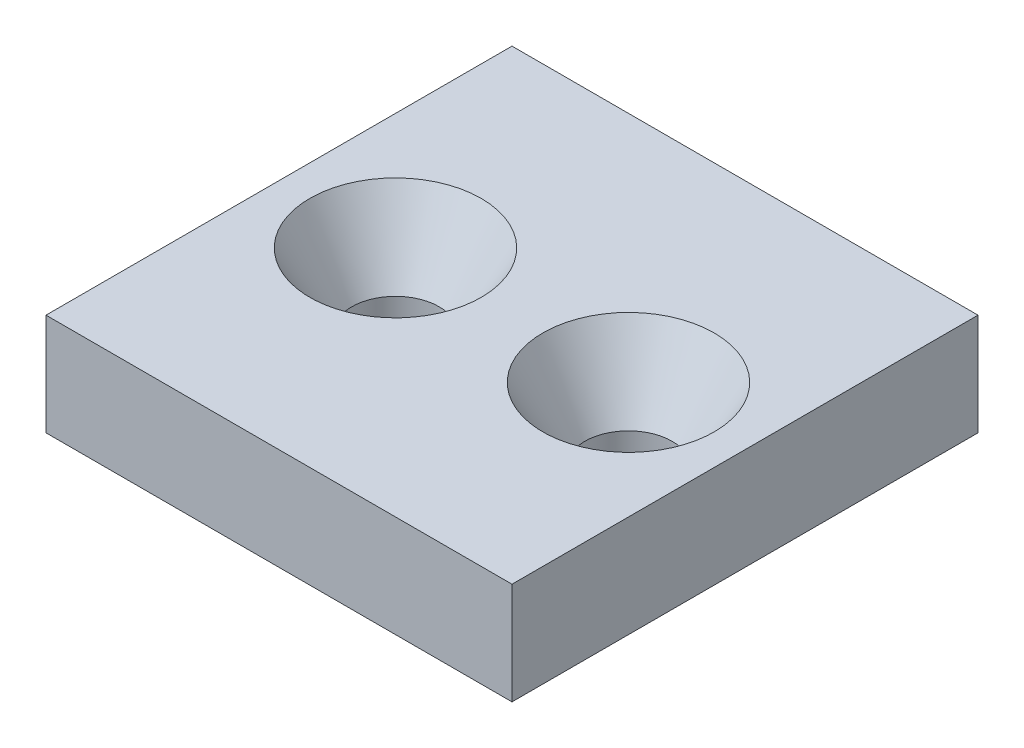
ISO-10303-21;
HEADER;
FILE_DESCRIPTION(('STEP AP214'),'2;1');
FILE_NAME('part.step','',(''),(''),'','','');
FILE_SCHEMA(('AUTOMOTIVE_DESIGN { 1 0 10303 214 1 1 1 1 }'));
ENDSEC;
DATA;
#1=APPLICATION_CONTEXT('core data for automotive mechanical design processes');
#2=APPLICATION_PROTOCOL_DEFINITION('international standard','automotive_design',2000,#1);
#3=PRODUCT_CONTEXT('',#1,'mechanical');
#4=PRODUCT('Part','Part','',(#3));
#5=PRODUCT_RELATED_PRODUCT_CATEGORY('part','',(#4));
#6=PRODUCT_DEFINITION_FORMATION('','',#4);
#7=PRODUCT_DEFINITION_CONTEXT('part definition',#1,'design');
#8=PRODUCT_DEFINITION('design','',#6,#7);
#9=PRODUCT_DEFINITION_SHAPE('','',#8);
#10=(LENGTH_UNIT() NAMED_UNIT(*) SI_UNIT(.MILLI.,.METRE.));
#11=(NAMED_UNIT(*) PLANE_ANGLE_UNIT() SI_UNIT($,.RADIAN.));
#12=(NAMED_UNIT(*) SI_UNIT($,.STERADIAN.) SOLID_ANGLE_UNIT());
#13=UNCERTAINTY_MEASURE_WITH_UNIT(LENGTH_MEASURE(1.E-05),#10,'distance_accuracy_value','');
#14=(GEOMETRIC_REPRESENTATION_CONTEXT(3) GLOBAL_UNCERTAINTY_ASSIGNED_CONTEXT((#13)) GLOBAL_UNIT_ASSIGNED_CONTEXT((#10,
#11,#12)) REPRESENTATION_CONTEXT('',''));
#15=CARTESIAN_POINT('',(0.,0.,0.));
#16=DIRECTION('',(0.,0.,1.));
#17=DIRECTION('',(1.,0.,0.));
#18=AXIS2_PLACEMENT_3D('',#15,#16,#17);
#19=CARTESIAN_POINT('',(16.,7.,-16.));
#20=DIRECTION('',(0.,-1.,0.));
#21=DIRECTION('',(0.,0.,-1.));
#22=AXIS2_PLACEMENT_3D('',#19,#20,#21);
#23=PLANE('',#22);
#24=CARTESIAN_POINT('',(-8.,7.,0.));
#25=DIRECTION('',(0.,-1.,0.));
#26=DIRECTION('',(0.,0.,-1.));
#27=AXIS2_PLACEMENT_3D('',#24,#25,#26);
#28=CIRCLE('',#27,5.88675134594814);
#29=CARTESIAN_POINT('',(-8.,7.,-5.88675134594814));
#30=VERTEX_POINT('',#29);
#31=EDGE_CURVE('E98',#30,#30,#28,.T.);
#32=ORIENTED_EDGE('',*,*,#31,.T.);
#33=EDGE_LOOP('',(#32));
#34=FACE_BOUND('',#33,.T.);
#35=DIRECTION('',(0.,0.,-1.));
#36=VECTOR('',#35,1.);
#37=CARTESIAN_POINT('',(16.,7.,16.));
#38=LINE('',#37,#36);
#39=CARTESIAN_POINT('',(16.,7.,16.));
#40=VERTEX_POINT('',#39);
#41=CARTESIAN_POINT('',(16.,7.,-16.));
#42=VERTEX_POINT('',#41);
#43=EDGE_CURVE('E83',#40,#42,#38,.T.);
#44=ORIENTED_EDGE('',*,*,#43,.T.);
#45=DIRECTION('',(-1.,0.,0.));
#46=VECTOR('',#45,1.);
#47=CARTESIAN_POINT('',(-16.,7.,-16.));
#48=LINE('',#47,#46);
#49=CARTESIAN_POINT('',(-16.,7.,-16.));
#50=VERTEX_POINT('',#49);
#51=EDGE_CURVE('E78',#42,#50,#48,.T.);
#52=ORIENTED_EDGE('',*,*,#51,.T.);
#53=DIRECTION('',(0.,0.,1.));
#54=VECTOR('',#53,1.);
#55=CARTESIAN_POINT('',(-16.,7.,16.));
#56=LINE('',#55,#54);
#57=CARTESIAN_POINT('',(-16.,7.,16.));
#58=VERTEX_POINT('',#57);
#59=EDGE_CURVE('E81',#50,#58,#56,.T.);
#60=ORIENTED_EDGE('',*,*,#59,.T.);
#61=DIRECTION('',(1.,0.,0.));
#62=VECTOR('',#61,1.);
#63=CARTESIAN_POINT('',(-16.,7.,16.));
#64=LINE('',#63,#62);
#65=EDGE_CURVE('E48',#58,#40,#64,.T.);
#66=ORIENTED_EDGE('',*,*,#65,.T.);
#67=EDGE_LOOP('',(#44,#52,#60,#66));
#68=FACE_BOUND('',#67,.T.);
#69=CARTESIAN_POINT('',(8.,7.,0.));
#70=DIRECTION('',(0.,1.,0.));
#71=DIRECTION('',(0.,0.,-1.));
#72=AXIS2_PLACEMENT_3D('',#69,#70,#71);
#73=CIRCLE('',#72,5.88675134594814);
#74=CARTESIAN_POINT('',(8.,7.,-5.88675134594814));
#75=VERTEX_POINT('',#74);
#76=EDGE_CURVE('E118',#75,#75,#73,.T.);
#77=ORIENTED_EDGE('',*,*,#76,.F.);
#78=EDGE_LOOP('',(#77));
#79=FACE_BOUND('',#78,.T.);
#80=ADVANCED_FACE('F31',(#34,#68,#79),#23,.F.);
#81=CARTESIAN_POINT('',(16.,0.,-16.));
#82=DIRECTION('',(0.,-1.,0.));
#83=DIRECTION('',(0.,0.,-1.));
#84=AXIS2_PLACEMENT_3D('',#81,#82,#83);
#85=PLANE('',#84);
#86=CARTESIAN_POINT('',(-8.,0.,0.));
#87=DIRECTION('',(0.,-1.,0.));
#88=DIRECTION('',(0.,0.,-1.));
#89=AXIS2_PLACEMENT_3D('',#86,#87,#88);
#90=CIRCLE('',#89,3.);
#91=CARTESIAN_POINT('',(-8.,0.,-3.));
#92=VERTEX_POINT('',#91);
#93=EDGE_CURVE('E115',#92,#92,#90,.T.);
#94=ORIENTED_EDGE('',*,*,#93,.F.);
#95=EDGE_LOOP('',(#94));
#96=FACE_BOUND('',#95,.T.);
#97=DIRECTION('',(0.,0.,-1.));
#98=VECTOR('',#97,1.);
#99=CARTESIAN_POINT('',(16.,0.,16.));
#100=LINE('',#99,#98);
#101=CARTESIAN_POINT('',(16.,0.,16.));
#102=VERTEX_POINT('',#101);
#103=CARTESIAN_POINT('',(16.,0.,-16.));
#104=VERTEX_POINT('',#103);
#105=EDGE_CURVE('E95',#102,#104,#100,.T.);
#106=ORIENTED_EDGE('',*,*,#105,.F.);
#107=DIRECTION('',(1.,0.,0.));
#108=VECTOR('',#107,1.);
#109=CARTESIAN_POINT('',(-16.,0.,16.));
#110=LINE('',#109,#108);
#111=CARTESIAN_POINT('',(-16.,0.,16.));
#112=VERTEX_POINT('',#111);
#113=EDGE_CURVE('E71',#112,#102,#110,.T.);
#114=ORIENTED_EDGE('',*,*,#113,.F.);
#115=DIRECTION('',(0.,0.,1.));
#116=VECTOR('',#115,1.);
#117=CARTESIAN_POINT('',(-16.,0.,16.));
#118=LINE('',#117,#116);
#119=CARTESIAN_POINT('',(-16.,0.,-16.));
#120=VERTEX_POINT('',#119);
#121=EDGE_CURVE('E65',#120,#112,#118,.T.);
#122=ORIENTED_EDGE('',*,*,#121,.F.);
#123=DIRECTION('',(-1.,0.,0.));
#124=VECTOR('',#123,1.);
#125=CARTESIAN_POINT('',(-16.,0.,-16.));
#126=LINE('',#125,#124);
#127=EDGE_CURVE('E87',#104,#120,#126,.T.);
#128=ORIENTED_EDGE('',*,*,#127,.F.);
#129=EDGE_LOOP('',(#106,#114,#122,#128));
#130=FACE_BOUND('',#129,.T.);
#131=CARTESIAN_POINT('',(8.,0.,0.));
#132=DIRECTION('',(0.,1.,0.));
#133=DIRECTION('',(0.,0.,-1.));
#134=AXIS2_PLACEMENT_3D('',#131,#132,#133);
#135=CIRCLE('',#134,3.);
#136=CARTESIAN_POINT('',(8.,0.,-3.));
#137=VERTEX_POINT('',#136);
#138=EDGE_CURVE('E124',#137,#137,#135,.T.);
#139=ORIENTED_EDGE('',*,*,#138,.T.);
#140=EDGE_LOOP('',(#139));
#141=FACE_BOUND('',#140,.T.);
#142=ADVANCED_FACE('F106',(#96,#130,#141),#85,.T.);
#143=CARTESIAN_POINT('',(16.,7.,16.));
#144=DIRECTION('',(-1.,0.,0.));
#145=DIRECTION('',(0.,0.,1.));
#146=AXIS2_PLACEMENT_3D('',#143,#144,#145);
#147=PLANE('',#146);
#148=ORIENTED_EDGE('',*,*,#105,.T.);
#149=DIRECTION('',(0.,-1.,0.));
#150=VECTOR('',#149,1.);
#151=CARTESIAN_POINT('',(16.,7.,-16.));
#152=LINE('',#151,#150);
#153=EDGE_CURVE('E11',#42,#104,#152,.T.);
#154=ORIENTED_EDGE('',*,*,#153,.F.);
#155=ORIENTED_EDGE('',*,*,#43,.F.);
#156=DIRECTION('',(0.,-1.,0.));
#157=VECTOR('',#156,1.);
#158=CARTESIAN_POINT('',(16.,7.,16.));
#159=LINE('',#158,#157);
#160=EDGE_CURVE('E91',#40,#102,#159,.T.);
#161=ORIENTED_EDGE('',*,*,#160,.T.);
#162=EDGE_LOOP('',(#148,#154,#155,#161));
#163=FACE_BOUND('',#162,.T.);
#164=ADVANCED_FACE('F33',(#163),#147,.F.);
#165=CARTESIAN_POINT('',(-16.,7.,-16.));
#166=DIRECTION('',(0.,0.,1.));
#167=DIRECTION('',(1.,0.,0.));
#168=AXIS2_PLACEMENT_3D('',#165,#166,#167);
#169=PLANE('',#168);
#170=ORIENTED_EDGE('',*,*,#127,.T.);
#171=DIRECTION('',(0.,-1.,0.));
#172=VECTOR('',#171,1.);
#173=CARTESIAN_POINT('',(-16.,7.,-16.));
#174=LINE('',#173,#172);
#175=EDGE_CURVE('E40',#50,#120,#174,.T.);
#176=ORIENTED_EDGE('',*,*,#175,.F.);
#177=ORIENTED_EDGE('',*,*,#51,.F.);
#178=ORIENTED_EDGE('',*,*,#153,.T.);
#179=EDGE_LOOP('',(#170,#176,#177,#178));
#180=FACE_BOUND('',#179,.T.);
#181=ADVANCED_FACE('F86',(#180),#169,.F.);
#182=CARTESIAN_POINT('',(-16.,7.,16.));
#183=DIRECTION('',(1.,0.,0.));
#184=DIRECTION('',(0.,0.,-1.));
#185=AXIS2_PLACEMENT_3D('',#182,#183,#184);
#186=PLANE('',#185);
#187=ORIENTED_EDGE('',*,*,#121,.T.);
#188=DIRECTION('',(0.,-1.,0.));
#189=VECTOR('',#188,1.);
#190=CARTESIAN_POINT('',(-16.,7.,16.));
#191=LINE('',#190,#189);
#192=EDGE_CURVE('E88',#58,#112,#191,.T.);
#193=ORIENTED_EDGE('',*,*,#192,.F.);
#194=ORIENTED_EDGE('',*,*,#59,.F.);
#195=ORIENTED_EDGE('',*,*,#175,.T.);
#196=EDGE_LOOP('',(#187,#193,#194,#195));
#197=FACE_BOUND('',#196,.T.);
#198=ADVANCED_FACE('F89',(#197),#186,.F.);
#199=CARTESIAN_POINT('',(-16.,7.,16.));
#200=DIRECTION('',(0.,0.,-1.));
#201=DIRECTION('',(-1.,0.,0.));
#202=AXIS2_PLACEMENT_3D('',#199,#200,#201);
#203=PLANE('',#202);
#204=ORIENTED_EDGE('',*,*,#113,.T.);
#205=ORIENTED_EDGE('',*,*,#160,.F.);
#206=ORIENTED_EDGE('',*,*,#65,.F.);
#207=ORIENTED_EDGE('',*,*,#192,.T.);
#208=EDGE_LOOP('',(#204,#205,#206,#207));
#209=FACE_BOUND('',#208,.T.);
#210=ADVANCED_FACE('F103',(#209),#203,.F.);
#211=CARTESIAN_POINT('',(-8.,7.,0.));
#212=DIRECTION('',(0.,1.,0.));
#213=DIRECTION('',(0.,0.,1.));
#214=AXIS2_PLACEMENT_3D('',#211,#212,#213);
#215=CONICAL_SURFACE('',#214,5.88675134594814,0.5235987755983);
#216=CARTESIAN_POINT('',(-8.,2.,0.));
#217=DIRECTION('',(0.,-1.,0.));
#218=DIRECTION('',(0.,0.,-1.));
#219=AXIS2_PLACEMENT_3D('',#216,#217,#218);
#220=CIRCLE('',#219,3.);
#221=CARTESIAN_POINT('',(-8.,2.,-3.));
#222=VERTEX_POINT('',#221);
#223=EDGE_CURVE('E112',#222,#222,#220,.T.);
#224=ORIENTED_EDGE('',*,*,#223,.T.);
#225=EDGE_LOOP('',(#224));
#226=FACE_BOUND('',#225,.T.);
#227=ORIENTED_EDGE('',*,*,#31,.F.);
#228=EDGE_LOOP('',(#227));
#229=FACE_BOUND('',#228,.T.);
#230=ADVANCED_FACE('F149',(#226,#229),#215,.F.);
#231=CARTESIAN_POINT('',(-8.,0.,0.));
#232=DIRECTION('',(0.,-1.,0.));
#233=DIRECTION('',(0.,0.,-1.));
#234=AXIS2_PLACEMENT_3D('',#231,#232,#233);
#235=CYLINDRICAL_SURFACE('',#234,3.);
#236=ORIENTED_EDGE('',*,*,#93,.T.);
#237=EDGE_LOOP('',(#236));
#238=FACE_BOUND('',#237,.T.);
#239=ORIENTED_EDGE('',*,*,#223,.F.);
#240=EDGE_LOOP('',(#239));
#241=FACE_BOUND('',#240,.T.);
#242=ADVANCED_FACE('F137',(#238,#241),#235,.F.);
#243=CARTESIAN_POINT('',(8.,7.,0.));
#244=DIRECTION('',(0.,1.,0.));
#245=DIRECTION('',(0.,0.,1.));
#246=AXIS2_PLACEMENT_3D('',#243,#244,#245);
#247=CONICAL_SURFACE('',#246,5.88675134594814,0.5235987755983);
#248=CARTESIAN_POINT('',(8.,2.,0.));
#249=DIRECTION('',(0.,1.,0.));
#250=DIRECTION('',(0.,0.,-1.));
#251=AXIS2_PLACEMENT_3D('',#248,#249,#250);
#252=CIRCLE('',#251,3.);
#253=CARTESIAN_POINT('',(8.,2.,-3.));
#254=VERTEX_POINT('',#253);
#255=EDGE_CURVE('E121',#254,#254,#252,.T.);
#256=ORIENTED_EDGE('',*,*,#255,.F.);
#257=EDGE_LOOP('',(#256));
#258=FACE_BOUND('',#257,.T.);
#259=ORIENTED_EDGE('',*,*,#76,.T.);
#260=EDGE_LOOP('',(#259));
#261=FACE_BOUND('',#260,.T.);
#262=ADVANCED_FACE('F131',(#258,#261),#247,.F.);
#263=CARTESIAN_POINT('',(8.,0.,0.));
#264=DIRECTION('',(0.,-1.,0.));
#265=DIRECTION('',(0.,0.,-1.));
#266=AXIS2_PLACEMENT_3D('',#263,#264,#265);
#267=CYLINDRICAL_SURFACE('',#266,3.);
#268=ORIENTED_EDGE('',*,*,#138,.F.);
#269=EDGE_LOOP('',(#268));
#270=FACE_BOUND('',#269,.T.);
#271=ORIENTED_EDGE('',*,*,#255,.T.);
#272=EDGE_LOOP('',(#271));
#273=FACE_BOUND('',#272,.T.);
#274=ADVANCED_FACE('F128',(#270,#273),#267,.F.);
#275=CLOSED_SHELL('',(#80,#142,#164,#181,#198,#210,#230,#242,#262,#274));
#276=MANIFOLD_SOLID_BREP('B2',#275);
#277=ADVANCED_BREP_SHAPE_REPRESENTATION('',(#18,#276),#14);
#278=SHAPE_DEFINITION_REPRESENTATION(#9,#277);
ENDSEC;
END-ISO-10303-21;
